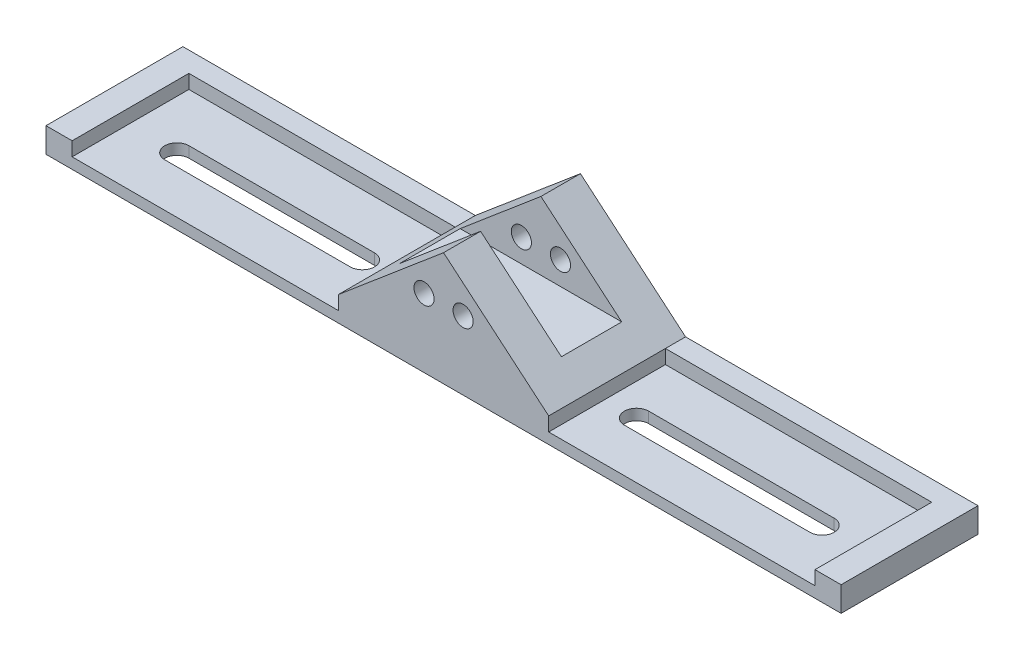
ISO-10303-21;
HEADER;
FILE_DESCRIPTION(('STEP AP214'),'2;1');
FILE_NAME('part.step','',(''),(''),'','','');
FILE_SCHEMA(('AUTOMOTIVE_DESIGN { 1 0 10303 214 1 1 1 1 }'));
ENDSEC;
DATA;
#1=APPLICATION_CONTEXT('core data for automotive mechanical design processes');
#2=APPLICATION_PROTOCOL_DEFINITION('international standard','automotive_design',2000,#1);
#3=PRODUCT_CONTEXT('',#1,'mechanical');
#4=PRODUCT('Part','Part','',(#3));
#5=PRODUCT_RELATED_PRODUCT_CATEGORY('part','',(#4));
#6=PRODUCT_DEFINITION_FORMATION('','',#4);
#7=PRODUCT_DEFINITION_CONTEXT('part definition',#1,'design');
#8=PRODUCT_DEFINITION('design','',#6,#7);
#9=PRODUCT_DEFINITION_SHAPE('','',#8);
#10=(LENGTH_UNIT() NAMED_UNIT(*) SI_UNIT(.MILLI.,.METRE.));
#11=(NAMED_UNIT(*) PLANE_ANGLE_UNIT() SI_UNIT($,.RADIAN.));
#12=(NAMED_UNIT(*) SI_UNIT($,.STERADIAN.) SOLID_ANGLE_UNIT());
#13=UNCERTAINTY_MEASURE_WITH_UNIT(LENGTH_MEASURE(1.E-05),#10,'distance_accuracy_value','');
#14=(GEOMETRIC_REPRESENTATION_CONTEXT(3) GLOBAL_UNCERTAINTY_ASSIGNED_CONTEXT((#13)) GLOBAL_UNIT_ASSIGNED_CONTEXT((#10,
#11,#12)) REPRESENTATION_CONTEXT('',''));
#15=CARTESIAN_POINT('',(0.,0.,0.));
#16=DIRECTION('',(0.,0.,1.));
#17=DIRECTION('',(1.,0.,0.));
#18=AXIS2_PLACEMENT_3D('',#15,#16,#17);
#19=CARTESIAN_POINT('',(-70.5231209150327,18.542,48.9541938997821));
#20=DIRECTION('',(0.,1.,0.));
#21=DIRECTION('',(0.,0.,1.));
#22=AXIS2_PLACEMENT_3D('',#19,#20,#21);
#23=PLANE('',#22);
#24=DIRECTION('',(-1.,0.,0.));
#25=VECTOR('',#24,1.);
#26=CARTESIAN_POINT('',(8.00572916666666,18.542,-38.265965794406));
#27=LINE('',#26,#25);
#28=CARTESIAN_POINT('',(206.95294283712,18.542,-38.265965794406));
#29=VERTEX_POINT('',#28);
#30=CARTESIAN_POINT('',(8.00572916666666,18.542,-38.265965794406));
#31=VERTEX_POINT('',#30);
#32=EDGE_CURVE('E377',#29,#31,#27,.T.);
#33=ORIENTED_EDGE('',*,*,#32,.F.);
#34=DIRECTION('',(0.,0.,-1.));
#35=VECTOR('',#34,1.);
#36=CARTESIAN_POINT('',(206.95294283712,18.542,48.9541938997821));
#37=LINE('',#36,#35);
#38=CARTESIAN_POINT('',(206.95294283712,18.542,48.9541938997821));
#39=VERTEX_POINT('',#38);
#40=EDGE_CURVE('E371',#39,#29,#37,.T.);
#41=ORIENTED_EDGE('',*,*,#40,.F.);
#42=DIRECTION('',(1.,0.,0.));
#43=VECTOR('',#42,1.);
#44=CARTESIAN_POINT('',(-70.5231209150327,18.542,48.9541938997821));
#45=LINE('',#44,#43);
#46=CARTESIAN_POINT('',(226.47339234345,18.542,48.9541938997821));
#47=VERTEX_POINT('',#46);
#48=EDGE_CURVE('E358',#39,#47,#45,.T.);
#49=ORIENTED_EDGE('',*,*,#48,.T.);
#50=DIRECTION('',(0.,0.,-1.));
#51=VECTOR('',#50,1.);
#52=CARTESIAN_POINT('',(226.47339234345,18.542,-53.3164488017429));
#53=LINE('',#52,#51);
#54=CARTESIAN_POINT('',(226.47339234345,18.542,-53.3164488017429));
#55=VERTEX_POINT('',#54);
#56=EDGE_CURVE('E361',#47,#55,#53,.T.);
#57=ORIENTED_EDGE('',*,*,#56,.T.);
#58=DIRECTION('',(-1.,0.,0.));
#59=VECTOR('',#58,1.);
#60=CARTESIAN_POINT('',(-70.5231209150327,18.542,-53.3164488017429));
#61=LINE('',#60,#59);
#62=CARTESIAN_POINT('',(8.00572916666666,18.542,-53.3164488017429));
#63=VERTEX_POINT('',#62);
#64=EDGE_CURVE('E342',#55,#63,#61,.T.);
#65=ORIENTED_EDGE('',*,*,#64,.T.);
#66=DIRECTION('',(0.,0.,1.));
#67=VECTOR('',#66,1.);
#68=CARTESIAN_POINT('',(8.00572916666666,18.542,-156.106389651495));
#69=LINE('',#68,#67);
#70=EDGE_CURVE('E332',#63,#31,#69,.T.);
#71=ORIENTED_EDGE('',*,*,#70,.T.);
#72=EDGE_LOOP('',(#33,#41,#49,#57,#65,#71));
#73=FACE_BOUND('',#72,.T.);
#74=ADVANCED_FACE('F26',(#73),#23,.T.);
#75=CARTESIAN_POINT('',(-70.5231209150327,18.542,48.9541938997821));
#76=DIRECTION('',(0.,0.,-1.));
#77=DIRECTION('',(-1.,0.,0.));
#78=AXIS2_PLACEMENT_3D('',#75,#76,#77);
#79=PLANE('',#78);
#80=CARTESIAN_POINT('',(-55.9159542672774,51.2780309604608,48.9541938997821));
#81=DIRECTION('',(0.,0.,1.));
#82=DIRECTION('',(1.,0.,0.));
#83=AXIS2_PLACEMENT_3D('',#80,#81,#82);
#84=CIRCLE('',#83,7.52590952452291);
#85=CARTESIAN_POINT('',(-48.3900447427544,51.2780309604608,48.9541938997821));
#86=VERTEX_POINT('',#85);
#87=EDGE_CURVE('E292',#86,#86,#84,.T.);
#88=ORIENTED_EDGE('',*,*,#87,.F.);
#89=EDGE_LOOP('',(#88));
#90=FACE_BOUND('',#89,.T.);
#91=DIRECTION('',(1.,0.,0.));
#92=VECTOR('',#91,1.);
#93=CARTESIAN_POINT('',(8.00572916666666,8.128,48.9541938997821));
#94=LINE('',#93,#92);
#95=CARTESIAN_POINT('',(8.00572916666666,8.128,48.9541938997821));
#96=VERTEX_POINT('',#95);
#97=CARTESIAN_POINT('',(206.95294283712,8.128,48.9541938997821));
#98=VERTEX_POINT('',#97);
#99=EDGE_CURVE('E396',#96,#98,#94,.T.);
#100=ORIENTED_EDGE('',*,*,#99,.F.);
#101=DIRECTION('',(0.,1.,0.));
#102=VECTOR('',#101,1.);
#103=CARTESIAN_POINT('',(8.00572916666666,8.128,48.9541938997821));
#104=LINE('',#103,#102);
#105=CARTESIAN_POINT('',(8.00572916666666,18.542,48.9541938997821));
#106=VERTEX_POINT('',#105);
#107=EDGE_CURVE('E331',#96,#106,#104,.T.);
#108=ORIENTED_EDGE('',*,*,#107,.T.);
#109=DIRECTION('',(-0.763974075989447,0.645246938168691,0.));
#110=VECTOR('',#109,1.);
#111=CARTESIAN_POINT('',(8.00572916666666,18.542,48.9541938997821));
#112=LINE('',#111,#110);
#113=CARTESIAN_POINT('',(-70.5231209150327,84.8668946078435,48.9541938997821));
#114=VERTEX_POINT('',#113);
#115=EDGE_CURVE('E325',#106,#114,#112,.T.);
#116=ORIENTED_EDGE('',*,*,#115,.T.);
#117=DIRECTION('',(0.763974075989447,0.645246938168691,0.));
#118=VECTOR('',#117,1.);
#119=CARTESIAN_POINT('',(-149.051970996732,18.542,48.9541938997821));
#120=LINE('',#119,#118);
#121=CARTESIAN_POINT('',(-149.051970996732,18.542,48.9541938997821));
#122=VERTEX_POINT('',#121);
#123=EDGE_CURVE('E259',#122,#114,#120,.T.);
#124=ORIENTED_EDGE('',*,*,#123,.F.);
#125=DIRECTION('',(0.,1.,0.));
#126=VECTOR('',#125,1.);
#127=CARTESIAN_POINT('',(-149.051970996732,8.128,48.9541938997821));
#128=LINE('',#127,#126);
#129=CARTESIAN_POINT('',(-149.051970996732,8.128,48.9541938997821));
#130=VERTEX_POINT('',#129);
#131=EDGE_CURVE('E256',#130,#122,#128,.T.);
#132=ORIENTED_EDGE('',*,*,#131,.F.);
#133=DIRECTION('',(-1.,0.,0.));
#134=VECTOR('',#133,1.);
#135=CARTESIAN_POINT('',(-149.051970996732,8.128,48.9541938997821));
#136=LINE('',#135,#134);
#137=CARTESIAN_POINT('',(-347.999184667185,8.128,48.9541938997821));
#138=VERTEX_POINT('',#137);
#139=EDGE_CURVE('E249',#130,#138,#136,.T.);
#140=ORIENTED_EDGE('',*,*,#139,.T.);
#141=DIRECTION('',(0.,1.,0.));
#142=VECTOR('',#141,1.);
#143=CARTESIAN_POINT('',(-347.999184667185,8.128,48.9541938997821));
#144=LINE('',#143,#142);
#145=CARTESIAN_POINT('',(-347.999184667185,18.542,48.9541938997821));
#146=VERTEX_POINT('',#145);
#147=EDGE_CURVE('E262',#138,#146,#144,.T.);
#148=ORIENTED_EDGE('',*,*,#147,.T.);
#149=DIRECTION('',(-1.,0.,0.));
#150=VECTOR('',#149,1.);
#151=CARTESIAN_POINT('',(-70.5231209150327,18.542,48.9541938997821));
#152=LINE('',#151,#150);
#153=CARTESIAN_POINT('',(-367.519634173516,18.542,48.9541938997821));
#154=VERTEX_POINT('',#153);
#155=EDGE_CURVE('E293',#146,#154,#152,.T.);
#156=ORIENTED_EDGE('',*,*,#155,.T.);
#157=DIRECTION('',(0.,-1.,0.));
#158=VECTOR('',#157,1.);
#159=CARTESIAN_POINT('',(-367.519634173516,18.542,48.9541938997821));
#160=LINE('',#159,#158);
#161=CARTESIAN_POINT('',(-367.519634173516,0.,48.9541938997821));
#162=VERTEX_POINT('',#161);
#163=EDGE_CURVE('E287',#154,#162,#160,.T.);
#164=ORIENTED_EDGE('',*,*,#163,.T.);
#165=DIRECTION('',(1.,0.,0.));
#166=VECTOR('',#165,1.);
#167=CARTESIAN_POINT('',(-70.5231209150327,0.,48.9541938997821));
#168=LINE('',#167,#166);
#169=CARTESIAN_POINT('',(226.47339234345,0.,48.9541938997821));
#170=VERTEX_POINT('',#169);
#171=EDGE_CURVE('E352',#162,#170,#168,.T.);
#172=ORIENTED_EDGE('',*,*,#171,.T.);
#173=DIRECTION('',(0.,-1.,0.));
#174=VECTOR('',#173,1.);
#175=CARTESIAN_POINT('',(226.47339234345,18.542,48.9541938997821));
#176=LINE('',#175,#174);
#177=EDGE_CURVE('E417',#47,#170,#176,.T.);
#178=ORIENTED_EDGE('',*,*,#177,.F.);
#179=ORIENTED_EDGE('',*,*,#48,.F.);
#180=DIRECTION('',(0.,1.,0.));
#181=VECTOR('',#180,1.);
#182=CARTESIAN_POINT('',(206.95294283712,8.128,48.9541938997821));
#183=LINE('',#182,#181);
#184=EDGE_CURVE('E366',#98,#39,#183,.T.);
#185=ORIENTED_EDGE('',*,*,#184,.F.);
#186=EDGE_LOOP('',(#100,#108,#116,#124,#132,#140,#148,#156,#164,#172,#178,#179,#185));
#187=FACE_BOUND('',#186,.T.);
#188=CARTESIAN_POINT('',(-85.130287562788,51.2780309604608,48.9541938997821));
#189=DIRECTION('',(0.,0.,-1.));
#190=DIRECTION('',(-1.,0.,0.));
#191=AXIS2_PLACEMENT_3D('',#188,#189,#190);
#192=CIRCLE('',#191,7.52590952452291);
#193=CARTESIAN_POINT('',(-92.6561970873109,51.2780309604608,48.9541938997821));
#194=VERTEX_POINT('',#193);
#195=EDGE_CURVE('E475',#194,#194,#192,.T.);
#196=ORIENTED_EDGE('',*,*,#195,.T.);
#197=EDGE_LOOP('',(#196));
#198=FACE_BOUND('',#197,.T.);
#199=ADVANCED_FACE('F28',(#90,#187,#198),#79,.F.);
#200=CARTESIAN_POINT('',(226.47339234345,18.542,-53.3164488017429));
#201=DIRECTION('',(-1.,0.,0.));
#202=DIRECTION('',(0.,0.,1.));
#203=AXIS2_PLACEMENT_3D('',#200,#201,#202);
#204=PLANE('',#203);
#205=DIRECTION('',(0.,0.,-1.));
#206=VECTOR('',#205,1.);
#207=CARTESIAN_POINT('',(226.47339234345,0.,-53.3164488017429));
#208=LINE('',#207,#206);
#209=CARTESIAN_POINT('',(226.47339234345,0.,-53.3164488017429));
#210=VERTEX_POINT('',#209);
#211=EDGE_CURVE('E354',#170,#210,#208,.T.);
#212=ORIENTED_EDGE('',*,*,#211,.T.);
#213=DIRECTION('',(0.,-1.,0.));
#214=VECTOR('',#213,1.);
#215=CARTESIAN_POINT('',(226.47339234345,18.542,-53.3164488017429));
#216=LINE('',#215,#214);
#217=EDGE_CURVE('E423',#55,#210,#216,.T.);
#218=ORIENTED_EDGE('',*,*,#217,.F.);
#219=ORIENTED_EDGE('',*,*,#56,.F.);
#220=ORIENTED_EDGE('',*,*,#177,.T.);
#221=EDGE_LOOP('',(#212,#218,#219,#220));
#222=FACE_BOUND('',#221,.T.);
#223=ADVANCED_FACE('F425',(#222),#204,.F.);
#224=CARTESIAN_POINT('',(-70.5231209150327,18.542,-53.3164488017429));
#225=DIRECTION('',(0.,0.,1.));
#226=DIRECTION('',(1.,0.,0.));
#227=AXIS2_PLACEMENT_3D('',#224,#225,#226);
#228=PLANE('',#227);
#229=CARTESIAN_POINT('',(-55.9159542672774,51.2780309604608,-53.3164488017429));
#230=DIRECTION('',(0.,0.,1.));
#231=DIRECTION('',(1.,0.,0.));
#232=AXIS2_PLACEMENT_3D('',#229,#230,#231);
#233=CIRCLE('',#232,7.52590952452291);
#234=CARTESIAN_POINT('',(-48.3900447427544,51.2780309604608,-53.3164488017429));
#235=VERTEX_POINT('',#234);
#236=EDGE_CURVE('E490',#235,#235,#233,.T.);
#237=ORIENTED_EDGE('',*,*,#236,.T.);
#238=EDGE_LOOP('',(#237));
#239=FACE_BOUND('',#238,.T.);
#240=DIRECTION('',(-1.,0.,0.));
#241=VECTOR('',#240,1.);
#242=CARTESIAN_POINT('',(-70.5231209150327,0.,-53.3164488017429));
#243=LINE('',#242,#241);
#244=CARTESIAN_POINT('',(-367.519634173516,0.,-53.3164488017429));
#245=VERTEX_POINT('',#244);
#246=EDGE_CURVE('E356',#210,#245,#243,.T.);
#247=ORIENTED_EDGE('',*,*,#246,.T.);
#248=DIRECTION('',(0.,-1.,0.));
#249=VECTOR('',#248,1.);
#250=CARTESIAN_POINT('',(-367.519634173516,18.542,-53.3164488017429));
#251=LINE('',#250,#249);
#252=CARTESIAN_POINT('',(-367.519634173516,18.542,-53.3164488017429));
#253=VERTEX_POINT('',#252);
#254=EDGE_CURVE('E305',#253,#245,#251,.T.);
#255=ORIENTED_EDGE('',*,*,#254,.F.);
#256=DIRECTION('',(1.,0.,0.));
#257=VECTOR('',#256,1.);
#258=CARTESIAN_POINT('',(-70.5231209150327,18.542,-53.3164488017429));
#259=LINE('',#258,#257);
#260=CARTESIAN_POINT('',(-149.051970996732,18.542,-53.3164488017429));
#261=VERTEX_POINT('',#260);
#262=EDGE_CURVE('E302',#253,#261,#259,.T.);
#263=ORIENTED_EDGE('',*,*,#262,.T.);
#264=DIRECTION('',(-0.763974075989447,-0.645246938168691,0.));
#265=VECTOR('',#264,1.);
#266=CARTESIAN_POINT('',(-149.051970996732,18.542,-53.3164488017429));
#267=LINE('',#266,#265);
#268=CARTESIAN_POINT('',(-70.5231209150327,84.8668946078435,-53.3164488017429));
#269=VERTEX_POINT('',#268);
#270=EDGE_CURVE('E267',#269,#261,#267,.T.);
#271=ORIENTED_EDGE('',*,*,#270,.F.);
#272=DIRECTION('',(0.763974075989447,-0.645246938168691,0.));
#273=VECTOR('',#272,1.);
#274=CARTESIAN_POINT('',(8.00572916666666,18.542,-53.3164488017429));
#275=LINE('',#274,#273);
#276=EDGE_CURVE('E336',#269,#63,#275,.T.);
#277=ORIENTED_EDGE('',*,*,#276,.T.);
#278=ORIENTED_EDGE('',*,*,#64,.F.);
#279=ORIENTED_EDGE('',*,*,#217,.T.);
#280=EDGE_LOOP('',(#247,#255,#263,#271,#277,#278,#279));
#281=FACE_BOUND('',#280,.T.);
#282=CARTESIAN_POINT('',(-85.130287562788,51.2780309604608,-53.3164488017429));
#283=DIRECTION('',(0.,0.,-1.));
#284=DIRECTION('',(-1.,0.,0.));
#285=AXIS2_PLACEMENT_3D('',#282,#283,#284);
#286=CIRCLE('',#285,7.52590952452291);
#287=CARTESIAN_POINT('',(-92.6561970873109,51.2780309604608,-53.3164488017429));
#288=VERTEX_POINT('',#287);
#289=EDGE_CURVE('E222',#288,#288,#286,.T.);
#290=ORIENTED_EDGE('',*,*,#289,.F.);
#291=EDGE_LOOP('',(#290));
#292=FACE_BOUND('',#291,.T.);
#293=ADVANCED_FACE('F433',(#239,#281,#292),#228,.F.);
#294=CARTESIAN_POINT('',(-70.5231209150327,0.,48.9541938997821));
#295=DIRECTION('',(0.,1.,0.));
#296=DIRECTION('',(0.,0.,1.));
#297=AXIS2_PLACEMENT_3D('',#294,#295,#296);
#298=PLANE('',#297);
#299=DIRECTION('',(1.,0.,0.));
#300=VECTOR('',#299,1.);
#301=CARTESIAN_POINT('',(170.465352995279,0.,16.2680207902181));
#302=LINE('',#301,#300);
#303=CARTESIAN_POINT('',(31.9043359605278,0.,16.2680207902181));
#304=VERTEX_POINT('',#303);
#305=CARTESIAN_POINT('',(170.465352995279,0.,16.2680207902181));
#306=VERTEX_POINT('',#305);
#307=EDGE_CURVE('E386',#304,#306,#302,.T.);
#308=ORIENTED_EDGE('',*,*,#307,.T.);
#309=CARTESIAN_POINT('',(170.465352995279,0.,7.17998742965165));
#310=DIRECTION('',(0.,1.,0.));
#311=DIRECTION('',(0.,0.,1.));
#312=AXIS2_PLACEMENT_3D('',#309,#310,#311);
#313=CIRCLE('',#312,9.08803336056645);
#314=CARTESIAN_POINT('',(170.465352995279,0.,-1.90804593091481));
#315=VERTEX_POINT('',#314);
#316=EDGE_CURVE('E502',#306,#315,#313,.T.);
#317=ORIENTED_EDGE('',*,*,#316,.T.);
#318=DIRECTION('',(-1.,0.,0.));
#319=VECTOR('',#318,1.);
#320=CARTESIAN_POINT('',(170.465352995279,0.,-1.90804593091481));
#321=LINE('',#320,#319);
#322=CARTESIAN_POINT('',(31.9043359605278,0.,-1.90804593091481));
#323=VERTEX_POINT('',#322);
#324=EDGE_CURVE('E505',#315,#323,#321,.T.);
#325=ORIENTED_EDGE('',*,*,#324,.T.);
#326=CARTESIAN_POINT('',(31.9043359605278,0.,7.17998742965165));
#327=DIRECTION('',(0.,1.,0.));
#328=DIRECTION('',(0.,0.,1.));
#329=AXIS2_PLACEMENT_3D('',#326,#327,#328);
#330=CIRCLE('',#329,9.08803336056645);
#331=EDGE_CURVE('E43',#323,#304,#330,.T.);
#332=ORIENTED_EDGE('',*,*,#331,.T.);
#333=EDGE_LOOP('',(#308,#317,#325,#332));
#334=FACE_BOUND('',#333,.T.);
#335=ORIENTED_EDGE('',*,*,#171,.F.);
#336=DIRECTION('',(0.,0.,-1.));
#337=VECTOR('',#336,1.);
#338=CARTESIAN_POINT('',(-367.519634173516,0.,-53.3164488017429));
#339=LINE('',#338,#337);
#340=EDGE_CURVE('E271',#162,#245,#339,.T.);
#341=ORIENTED_EDGE('',*,*,#340,.T.);
#342=ORIENTED_EDGE('',*,*,#246,.F.);
#343=ORIENTED_EDGE('',*,*,#211,.F.);
#344=EDGE_LOOP('',(#335,#341,#342,#343));
#345=FACE_BOUND('',#344,.T.);
#346=DIRECTION('',(-1.,0.,0.));
#347=VECTOR('',#346,1.);
#348=CARTESIAN_POINT('',(-311.511594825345,0.,16.2680207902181));
#349=LINE('',#348,#347);
#350=CARTESIAN_POINT('',(-172.950577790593,0.,16.2680207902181));
#351=VERTEX_POINT('',#350);
#352=CARTESIAN_POINT('',(-311.511594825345,0.,16.2680207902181));
#353=VERTEX_POINT('',#352);
#354=EDGE_CURVE('E233',#351,#353,#349,.T.);
#355=ORIENTED_EDGE('',*,*,#354,.F.);
#356=CARTESIAN_POINT('',(-172.950577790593,0.,7.17998742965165));
#357=DIRECTION('',(0.,-1.,0.));
#358=DIRECTION('',(0.,0.,1.));
#359=AXIS2_PLACEMENT_3D('',#356,#357,#358);
#360=CIRCLE('',#359,9.08803336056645);
#361=CARTESIAN_POINT('',(-172.950577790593,0.,-1.90804593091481));
#362=VERTEX_POINT('',#361);
#363=EDGE_CURVE('E231',#362,#351,#360,.T.);
#364=ORIENTED_EDGE('',*,*,#363,.F.);
#365=DIRECTION('',(1.,0.,0.));
#366=VECTOR('',#365,1.);
#367=CARTESIAN_POINT('',(-311.511594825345,0.,-1.90804593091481));
#368=LINE('',#367,#366);
#369=CARTESIAN_POINT('',(-311.511594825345,0.,-1.90804593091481));
#370=VERTEX_POINT('',#369);
#371=EDGE_CURVE('E201',#370,#362,#368,.T.);
#372=ORIENTED_EDGE('',*,*,#371,.F.);
#373=CARTESIAN_POINT('',(-311.511594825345,0.,7.17998742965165));
#374=DIRECTION('',(0.,-1.,0.));
#375=DIRECTION('',(0.,0.,1.));
#376=AXIS2_PLACEMENT_3D('',#373,#374,#375);
#377=CIRCLE('',#376,9.08803336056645);
#378=EDGE_CURVE('E227',#353,#370,#377,.T.);
#379=ORIENTED_EDGE('',*,*,#378,.F.);
#380=EDGE_LOOP('',(#355,#364,#372,#379));
#381=FACE_BOUND('',#380,.T.);
#382=ADVANCED_FACE('F438',(#334,#345,#381),#298,.F.);
#383=CARTESIAN_POINT('',(8.00572916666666,18.542,-156.106389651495));
#384=DIRECTION('',(0.645246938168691,0.763974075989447,0.));
#385=DIRECTION('',(-0.763974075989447,0.645246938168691,0.));
#386=AXIS2_PLACEMENT_3D('',#383,#384,#385);
#387=PLANE('',#386);
#388=DIRECTION('',(-0.763974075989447,0.645246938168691,0.));
#389=VECTOR('',#388,1.);
#390=CARTESIAN_POINT('',(8.00572916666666,18.542,-23.7907597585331));
#391=LINE('',#390,#389);
#392=CARTESIAN_POINT('',(-10.1569358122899,33.8820545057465,-23.7907597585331));
#393=VERTEX_POINT('',#392);
#394=CARTESIAN_POINT('',(-70.5231209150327,84.8668946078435,-23.7907597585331));
#395=VERTEX_POINT('',#394);
#396=EDGE_CURVE('E11',#393,#395,#391,.T.);
#397=ORIENTED_EDGE('',*,*,#396,.F.);
#398=DIRECTION('',(0.,0.,-1.));
#399=VECTOR('',#398,1.);
#400=CARTESIAN_POINT('',(-10.1569358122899,33.8820545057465,-156.106389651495));
#401=LINE('',#400,#399);
#402=CARTESIAN_POINT('',(-10.1569358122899,33.8820545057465,21.2774573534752));
#403=VERTEX_POINT('',#402);
#404=EDGE_CURVE('E422',#403,#393,#401,.T.);
#405=ORIENTED_EDGE('',*,*,#404,.F.);
#406=DIRECTION('',(0.763974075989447,-0.645246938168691,0.));
#407=VECTOR('',#406,1.);
#408=CARTESIAN_POINT('',(8.00572916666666,18.542,21.2774573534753));
#409=LINE('',#408,#407);
#410=CARTESIAN_POINT('',(-70.5231209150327,84.8668946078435,21.2774573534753));
#411=VERTEX_POINT('',#410);
#412=EDGE_CURVE('E35',#411,#403,#409,.T.);
#413=ORIENTED_EDGE('',*,*,#412,.F.);
#414=DIRECTION('',(0.,0.,1.));
#415=VECTOR('',#414,1.);
#416=CARTESIAN_POINT('',(-70.5231209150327,84.8668946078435,-156.106389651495));
#417=LINE('',#416,#415);
#418=EDGE_CURVE('E268',#411,#114,#417,.T.);
#419=ORIENTED_EDGE('',*,*,#418,.T.);
#420=ORIENTED_EDGE('',*,*,#115,.F.);
#421=DIRECTION('',(0.,0.,1.));
#422=VECTOR('',#421,1.);
#423=CARTESIAN_POINT('',(8.00572916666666,18.542,48.9541938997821));
#424=LINE('',#423,#422);
#425=EDGE_CURVE('E370',#31,#106,#424,.T.);
#426=ORIENTED_EDGE('',*,*,#425,.F.);
#427=ORIENTED_EDGE('',*,*,#70,.F.);
#428=ORIENTED_EDGE('',*,*,#276,.F.);
#429=EDGE_CURVE('E264',#269,#395,#417,.T.);
#430=ORIENTED_EDGE('',*,*,#429,.T.);
#431=EDGE_LOOP('',(#397,#405,#413,#419,#420,#426,#427,#428,#430));
#432=FACE_BOUND('',#431,.T.);
#433=ADVANCED_FACE('F323',(#432),#387,.T.);
#434=CARTESIAN_POINT('',(226.47341734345,84.8668946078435,-23.7907597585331));
#435=DIRECTION('',(0.,0.,-1.));
#436=DIRECTION('',(-1.,0.,0.));
#437=AXIS2_PLACEMENT_3D('',#434,#435,#436);
#438=PLANE('',#437);
#439=CARTESIAN_POINT('',(-55.9159542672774,51.2780309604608,-23.7907597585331));
#440=DIRECTION('',(0.,0.,-1.));
#441=DIRECTION('',(-1.,0.,0.));
#442=AXIS2_PLACEMENT_3D('',#439,#440,#441);
#443=CIRCLE('',#442,7.52590952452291);
#444=CARTESIAN_POINT('',(-63.4418637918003,51.2780309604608,-23.7907597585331));
#445=VERTEX_POINT('',#444);
#446=EDGE_CURVE('E487',#445,#445,#443,.T.);
#447=ORIENTED_EDGE('',*,*,#446,.T.);
#448=EDGE_LOOP('',(#447));
#449=FACE_BOUND('',#448,.T.);
#450=ORIENTED_EDGE('',*,*,#396,.T.);
#451=DIRECTION('',(0.763974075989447,0.645246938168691,0.));
#452=VECTOR('',#451,1.);
#453=CARTESIAN_POINT('',(-149.051970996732,18.542,-23.7907597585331));
#454=LINE('',#453,#452);
#455=CARTESIAN_POINT('',(-130.889306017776,33.8820545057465,-23.7907597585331));
#456=VERTEX_POINT('',#455);
#457=EDGE_CURVE('E290',#456,#395,#454,.T.);
#458=ORIENTED_EDGE('',*,*,#457,.F.);
#459=DIRECTION('',(-1.,0.,0.));
#460=VECTOR('',#459,1.);
#461=CARTESIAN_POINT('',(226.47341734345,33.8820545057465,-23.7907597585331));
#462=LINE('',#461,#460);
#463=EDGE_CURVE('E338',#393,#456,#462,.T.);
#464=ORIENTED_EDGE('',*,*,#463,.F.);
#465=EDGE_LOOP('',(#450,#458,#464));
#466=FACE_BOUND('',#465,.T.);
#467=CARTESIAN_POINT('',(-85.130287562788,51.2780309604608,-23.7907597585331));
#468=DIRECTION('',(0.,0.,1.));
#469=DIRECTION('',(1.,0.,0.));
#470=AXIS2_PLACEMENT_3D('',#467,#468,#469);
#471=CIRCLE('',#470,7.52590952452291);
#472=CARTESIAN_POINT('',(-77.6043780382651,51.2780309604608,-23.7907597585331));
#473=VERTEX_POINT('',#472);
#474=EDGE_CURVE('E474',#473,#473,#471,.T.);
#475=ORIENTED_EDGE('',*,*,#474,.F.);
#476=EDGE_LOOP('',(#475));
#477=FACE_BOUND('',#476,.T.);
#478=ADVANCED_FACE('F457',(#449,#466,#477),#438,.F.);
#479=CARTESIAN_POINT('',(226.47341734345,84.8668946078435,21.2774573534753));
#480=DIRECTION('',(0.,0.,1.));
#481=DIRECTION('',(1.,0.,0.));
#482=AXIS2_PLACEMENT_3D('',#479,#480,#481);
#483=PLANE('',#482);
#484=CARTESIAN_POINT('',(-55.9159542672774,51.2780309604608,21.2774573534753));
#485=DIRECTION('',(0.,0.,1.));
#486=DIRECTION('',(1.,0.,0.));
#487=AXIS2_PLACEMENT_3D('',#484,#485,#486);
#488=CIRCLE('',#487,7.52590952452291);
#489=CARTESIAN_POINT('',(-48.3900447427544,51.2780309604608,21.2774573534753));
#490=VERTEX_POINT('',#489);
#491=EDGE_CURVE('E30',#490,#490,#488,.T.);
#492=ORIENTED_EDGE('',*,*,#491,.T.);
#493=EDGE_LOOP('',(#492));
#494=FACE_BOUND('',#493,.T.);
#495=ORIENTED_EDGE('',*,*,#412,.T.);
#496=DIRECTION('',(-1.,0.,0.));
#497=VECTOR('',#496,1.);
#498=CARTESIAN_POINT('',(226.47341734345,33.8820545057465,21.2774573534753));
#499=LINE('',#498,#497);
#500=CARTESIAN_POINT('',(-130.889306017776,33.8820545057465,21.2774573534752));
#501=VERTEX_POINT('',#500);
#502=EDGE_CURVE('E333',#403,#501,#499,.T.);
#503=ORIENTED_EDGE('',*,*,#502,.T.);
#504=DIRECTION('',(-0.763974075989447,-0.645246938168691,0.));
#505=VECTOR('',#504,1.);
#506=CARTESIAN_POINT('',(-149.051970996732,18.542,21.2774573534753));
#507=LINE('',#506,#505);
#508=EDGE_CURVE('E286',#411,#501,#507,.T.);
#509=ORIENTED_EDGE('',*,*,#508,.F.);
#510=EDGE_LOOP('',(#495,#503,#509));
#511=FACE_BOUND('',#510,.T.);
#512=CARTESIAN_POINT('',(-85.130287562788,51.2780309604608,21.2774573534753));
#513=DIRECTION('',(0.,0.,-1.));
#514=DIRECTION('',(-1.,0.,0.));
#515=AXIS2_PLACEMENT_3D('',#512,#513,#514);
#516=CIRCLE('',#515,7.52590952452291);
#517=CARTESIAN_POINT('',(-92.6561970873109,51.2780309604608,21.2774573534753));
#518=VERTEX_POINT('',#517);
#519=EDGE_CURVE('E472',#518,#518,#516,.T.);
#520=ORIENTED_EDGE('',*,*,#519,.F.);
#521=EDGE_LOOP('',(#520));
#522=FACE_BOUND('',#521,.T.);
#523=ADVANCED_FACE('F463',(#494,#511,#522),#483,.F.);
#524=CARTESIAN_POINT('',(226.47341734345,33.8820545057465,-23.7907597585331));
#525=DIRECTION('',(0.,-1.,0.));
#526=DIRECTION('',(0.,0.,-1.));
#527=AXIS2_PLACEMENT_3D('',#524,#525,#526);
#528=PLANE('',#527);
#529=ORIENTED_EDGE('',*,*,#404,.T.);
#530=ORIENTED_EDGE('',*,*,#463,.T.);
#531=DIRECTION('',(0.,0.,-1.));
#532=VECTOR('',#531,1.);
#533=CARTESIAN_POINT('',(-130.889306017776,33.8820545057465,-156.106389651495));
#534=LINE('',#533,#532);
#535=EDGE_CURVE('E283',#501,#456,#534,.T.);
#536=ORIENTED_EDGE('',*,*,#535,.F.);
#537=ORIENTED_EDGE('',*,*,#502,.F.);
#538=EDGE_LOOP('',(#529,#530,#536,#537));
#539=FACE_BOUND('',#538,.T.);
#540=ADVANCED_FACE('F461',(#539),#528,.F.);
#541=CARTESIAN_POINT('',(8.00572916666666,8.128,48.9541938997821));
#542=DIRECTION('',(-1.,0.,0.));
#543=DIRECTION('',(0.,0.,1.));
#544=AXIS2_PLACEMENT_3D('',#541,#542,#543);
#545=PLANE('',#544);
#546=ORIENTED_EDGE('',*,*,#425,.T.);
#547=ORIENTED_EDGE('',*,*,#107,.F.);
#548=DIRECTION('',(0.,0.,1.));
#549=VECTOR('',#548,1.);
#550=CARTESIAN_POINT('',(8.00572916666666,8.128,48.9541938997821));
#551=LINE('',#550,#549);
#552=CARTESIAN_POINT('',(8.00572916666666,8.128,-38.265965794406));
#553=VERTEX_POINT('',#552);
#554=EDGE_CURVE('E393',#553,#96,#551,.T.);
#555=ORIENTED_EDGE('',*,*,#554,.F.);
#556=DIRECTION('',(0.,1.,0.));
#557=VECTOR('',#556,1.);
#558=CARTESIAN_POINT('',(8.00572916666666,8.128,-38.265965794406));
#559=LINE('',#558,#557);
#560=EDGE_CURVE('E404',#553,#31,#559,.T.);
#561=ORIENTED_EDGE('',*,*,#560,.T.);
#562=EDGE_LOOP('',(#546,#547,#555,#561));
#563=FACE_BOUND('',#562,.T.);
#564=ADVANCED_FACE('F527',(#563),#545,.F.);
#565=CARTESIAN_POINT('',(8.00572916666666,8.128,-38.265965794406));
#566=DIRECTION('',(0.,0.,-1.));
#567=DIRECTION('',(-1.,0.,0.));
#568=AXIS2_PLACEMENT_3D('',#565,#566,#567);
#569=PLANE('',#568);
#570=ORIENTED_EDGE('',*,*,#32,.T.);
#571=ORIENTED_EDGE('',*,*,#560,.F.);
#572=DIRECTION('',(-1.,0.,0.));
#573=VECTOR('',#572,1.);
#574=CARTESIAN_POINT('',(8.00572916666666,8.128,-38.265965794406));
#575=LINE('',#574,#573);
#576=CARTESIAN_POINT('',(206.95294283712,8.128,-38.265965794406));
#577=VERTEX_POINT('',#576);
#578=EDGE_CURVE('E367',#577,#553,#575,.T.);
#579=ORIENTED_EDGE('',*,*,#578,.F.);
#580=DIRECTION('',(0.,1.,0.));
#581=VECTOR('',#580,1.);
#582=CARTESIAN_POINT('',(206.95294283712,8.128,-38.265965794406));
#583=LINE('',#582,#581);
#584=EDGE_CURVE('E406',#577,#29,#583,.T.);
#585=ORIENTED_EDGE('',*,*,#584,.T.);
#586=EDGE_LOOP('',(#570,#571,#579,#585));
#587=FACE_BOUND('',#586,.T.);
#588=ADVANCED_FACE('F529',(#587),#569,.F.);
#589=CARTESIAN_POINT('',(206.95294283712,8.128,48.9541938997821));
#590=DIRECTION('',(1.,0.,0.));
#591=DIRECTION('',(0.,0.,-1.));
#592=AXIS2_PLACEMENT_3D('',#589,#590,#591);
#593=PLANE('',#592);
#594=ORIENTED_EDGE('',*,*,#40,.T.);
#595=ORIENTED_EDGE('',*,*,#584,.F.);
#596=DIRECTION('',(0.,0.,-1.));
#597=VECTOR('',#596,1.);
#598=CARTESIAN_POINT('',(206.95294283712,8.128,48.9541938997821));
#599=LINE('',#598,#597);
#600=EDGE_CURVE('E399',#98,#577,#599,.T.);
#601=ORIENTED_EDGE('',*,*,#600,.F.);
#602=ORIENTED_EDGE('',*,*,#184,.T.);
#603=EDGE_LOOP('',(#594,#595,#601,#602));
#604=FACE_BOUND('',#603,.T.);
#605=ADVANCED_FACE('F411',(#604),#593,.F.);
#606=CARTESIAN_POINT('',(8.00572916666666,8.128,-38.265965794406));
#607=DIRECTION('',(0.,-1.,0.));
#608=DIRECTION('',(0.,0.,-1.));
#609=AXIS2_PLACEMENT_3D('',#606,#607,#608);
#610=PLANE('',#609);
#611=DIRECTION('',(-1.,0.,0.));
#612=VECTOR('',#611,1.);
#613=CARTESIAN_POINT('',(170.465352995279,8.128,-1.90804593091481));
#614=LINE('',#613,#612);
#615=CARTESIAN_POINT('',(170.465352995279,8.128,-1.90804593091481));
#616=VERTEX_POINT('',#615);
#617=CARTESIAN_POINT('',(31.9043359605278,8.128,-1.90804593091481));
#618=VERTEX_POINT('',#617);
#619=EDGE_CURVE('E494',#616,#618,#614,.T.);
#620=ORIENTED_EDGE('',*,*,#619,.F.);
#621=CARTESIAN_POINT('',(170.465352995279,8.128,7.17998742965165));
#622=DIRECTION('',(0.,1.,0.));
#623=DIRECTION('',(0.,0.,1.));
#624=AXIS2_PLACEMENT_3D('',#621,#622,#623);
#625=CIRCLE('',#624,9.08803336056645);
#626=CARTESIAN_POINT('',(170.465352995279,8.128,16.2680207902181));
#627=VERTEX_POINT('',#626);
#628=EDGE_CURVE('E51',#627,#616,#625,.T.);
#629=ORIENTED_EDGE('',*,*,#628,.F.);
#630=DIRECTION('',(1.,0.,0.));
#631=VECTOR('',#630,1.);
#632=CARTESIAN_POINT('',(170.465352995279,8.128,16.2680207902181));
#633=LINE('',#632,#631);
#634=CARTESIAN_POINT('',(31.9043359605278,8.128,16.2680207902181));
#635=VERTEX_POINT('',#634);
#636=EDGE_CURVE('E500',#635,#627,#633,.T.);
#637=ORIENTED_EDGE('',*,*,#636,.F.);
#638=CARTESIAN_POINT('',(31.9043359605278,8.128,7.17998742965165));
#639=DIRECTION('',(0.,1.,0.));
#640=DIRECTION('',(0.,0.,1.));
#641=AXIS2_PLACEMENT_3D('',#638,#639,#640);
#642=CIRCLE('',#641,9.08803336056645);
#643=EDGE_CURVE('E497',#618,#635,#642,.T.);
#644=ORIENTED_EDGE('',*,*,#643,.F.);
#645=EDGE_LOOP('',(#620,#629,#637,#644));
#646=FACE_BOUND('',#645,.T.);
#647=ORIENTED_EDGE('',*,*,#554,.T.);
#648=ORIENTED_EDGE('',*,*,#99,.T.);
#649=ORIENTED_EDGE('',*,*,#600,.T.);
#650=ORIENTED_EDGE('',*,*,#578,.T.);
#651=EDGE_LOOP('',(#647,#648,#649,#650));
#652=FACE_BOUND('',#651,.T.);
#653=ADVANCED_FACE('F521',(#646,#652),#610,.F.);
#654=CARTESIAN_POINT('',(170.465352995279,0.,7.17998742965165));
#655=DIRECTION('',(0.,1.,0.));
#656=DIRECTION('',(0.,0.,1.));
#657=AXIS2_PLACEMENT_3D('',#654,#655,#656);
#658=CYLINDRICAL_SURFACE('',#657,9.08803336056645);
#659=ORIENTED_EDGE('',*,*,#628,.T.);
#660=DIRECTION('',(0.,1.,0.));
#661=VECTOR('',#660,1.);
#662=CARTESIAN_POINT('',(170.465352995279,0.,-1.90804593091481));
#663=LINE('',#662,#661);
#664=EDGE_CURVE('E390',#315,#616,#663,.T.);
#665=ORIENTED_EDGE('',*,*,#664,.F.);
#666=ORIENTED_EDGE('',*,*,#316,.F.);
#667=DIRECTION('',(0.,1.,0.));
#668=VECTOR('',#667,1.);
#669=CARTESIAN_POINT('',(170.465352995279,0.,16.2680207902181));
#670=LINE('',#669,#668);
#671=EDGE_CURVE('E372',#306,#627,#670,.T.);
#672=ORIENTED_EDGE('',*,*,#671,.T.);
#673=EDGE_LOOP('',(#659,#665,#666,#672));
#674=FACE_BOUND('',#673,.T.);
#675=ADVANCED_FACE('F513',(#674),#658,.F.);
#676=CARTESIAN_POINT('',(170.465352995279,0.,16.2680207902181));
#677=DIRECTION('',(0.,0.,1.));
#678=DIRECTION('',(1.,0.,0.));
#679=AXIS2_PLACEMENT_3D('',#676,#677,#678);
#680=PLANE('',#679);
#681=ORIENTED_EDGE('',*,*,#636,.T.);
#682=ORIENTED_EDGE('',*,*,#671,.F.);
#683=ORIENTED_EDGE('',*,*,#307,.F.);
#684=DIRECTION('',(0.,1.,0.));
#685=VECTOR('',#684,1.);
#686=CARTESIAN_POINT('',(31.9043359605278,0.,16.2680207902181));
#687=LINE('',#686,#685);
#688=EDGE_CURVE('E379',#304,#635,#687,.T.);
#689=ORIENTED_EDGE('',*,*,#688,.T.);
#690=EDGE_LOOP('',(#681,#682,#683,#689));
#691=FACE_BOUND('',#690,.T.);
#692=ADVANCED_FACE('F511',(#691),#680,.F.);
#693=CARTESIAN_POINT('',(31.9043359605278,0.,7.17998742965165));
#694=DIRECTION('',(0.,1.,0.));
#695=DIRECTION('',(0.,0.,1.));
#696=AXIS2_PLACEMENT_3D('',#693,#694,#695);
#697=CYLINDRICAL_SURFACE('',#696,9.08803336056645);
#698=ORIENTED_EDGE('',*,*,#643,.T.);
#699=ORIENTED_EDGE('',*,*,#688,.F.);
#700=ORIENTED_EDGE('',*,*,#331,.F.);
#701=DIRECTION('',(0.,1.,0.));
#702=VECTOR('',#701,1.);
#703=CARTESIAN_POINT('',(31.9043359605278,0.,-1.90804593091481));
#704=LINE('',#703,#702);
#705=EDGE_CURVE('E383',#323,#618,#704,.T.);
#706=ORIENTED_EDGE('',*,*,#705,.T.);
#707=EDGE_LOOP('',(#698,#699,#700,#706));
#708=FACE_BOUND('',#707,.T.);
#709=ADVANCED_FACE('F519',(#708),#697,.F.);
#710=CARTESIAN_POINT('',(170.465352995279,0.,-1.90804593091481));
#711=DIRECTION('',(0.,0.,-1.));
#712=DIRECTION('',(-1.,0.,0.));
#713=AXIS2_PLACEMENT_3D('',#710,#711,#712);
#714=PLANE('',#713);
#715=ORIENTED_EDGE('',*,*,#619,.T.);
#716=ORIENTED_EDGE('',*,*,#705,.F.);
#717=ORIENTED_EDGE('',*,*,#324,.F.);
#718=ORIENTED_EDGE('',*,*,#664,.T.);
#719=EDGE_LOOP('',(#715,#716,#717,#718));
#720=FACE_BOUND('',#719,.T.);
#721=ADVANCED_FACE('F517',(#720),#714,.F.);
#722=CARTESIAN_POINT('',(-55.9159542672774,51.2780309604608,-53.3164988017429));
#723=DIRECTION('',(0.,0.,1.));
#724=DIRECTION('',(1.,0.,0.));
#725=AXIS2_PLACEMENT_3D('',#722,#723,#724);
#726=CYLINDRICAL_SURFACE('',#725,7.52590952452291);
#727=ORIENTED_EDGE('',*,*,#87,.T.);
#728=EDGE_LOOP('',(#727));
#729=FACE_BOUND('',#728,.T.);
#730=ORIENTED_EDGE('',*,*,#491,.F.);
#731=EDGE_LOOP('',(#730));
#732=FACE_BOUND('',#731,.T.);
#733=ADVANCED_FACE('F586',(#729,#732),#726,.F.);
#734=ORIENTED_EDGE('',*,*,#446,.F.);
#735=EDGE_LOOP('',(#734));
#736=FACE_BOUND('',#735,.T.);
#737=ORIENTED_EDGE('',*,*,#236,.F.);
#738=EDGE_LOOP('',(#737));
#739=FACE_BOUND('',#738,.T.);
#740=ADVANCED_FACE('F619',(#736,#739),#726,.F.);
#741=CARTESIAN_POINT('',(-70.5231209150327,18.542,48.9541938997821));
#742=DIRECTION('',(0.,1.,0.));
#743=DIRECTION('',(0.,0.,1.));
#744=AXIS2_PLACEMENT_3D('',#741,#742,#743);
#745=PLANE('',#744);
#746=DIRECTION('',(1.,0.,0.));
#747=VECTOR('',#746,1.);
#748=CARTESIAN_POINT('',(-149.051970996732,18.542,-38.265965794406));
#749=LINE('',#748,#747);
#750=CARTESIAN_POINT('',(-347.999184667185,18.542,-38.265965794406));
#751=VERTEX_POINT('',#750);
#752=CARTESIAN_POINT('',(-149.051970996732,18.542,-38.265965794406));
#753=VERTEX_POINT('',#752);
#754=EDGE_CURVE('E244',#751,#753,#749,.T.);
#755=ORIENTED_EDGE('',*,*,#754,.T.);
#756=DIRECTION('',(0.,0.,1.));
#757=VECTOR('',#756,1.);
#758=CARTESIAN_POINT('',(-149.051970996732,18.542,-156.106389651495));
#759=LINE('',#758,#757);
#760=EDGE_CURVE('E274',#261,#753,#759,.T.);
#761=ORIENTED_EDGE('',*,*,#760,.F.);
#762=ORIENTED_EDGE('',*,*,#262,.F.);
#763=DIRECTION('',(0.,0.,-1.));
#764=VECTOR('',#763,1.);
#765=CARTESIAN_POINT('',(-367.519634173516,18.542,-53.3164488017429));
#766=LINE('',#765,#764);
#767=EDGE_CURVE('E296',#154,#253,#766,.T.);
#768=ORIENTED_EDGE('',*,*,#767,.F.);
#769=ORIENTED_EDGE('',*,*,#155,.F.);
#770=DIRECTION('',(0.,0.,-1.));
#771=VECTOR('',#770,1.);
#772=CARTESIAN_POINT('',(-347.999184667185,18.542,48.9541938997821));
#773=LINE('',#772,#771);
#774=EDGE_CURVE('E241',#146,#751,#773,.T.);
#775=ORIENTED_EDGE('',*,*,#774,.T.);
#776=EDGE_LOOP('',(#755,#761,#762,#768,#769,#775));
#777=FACE_BOUND('',#776,.T.);
#778=ADVANCED_FACE('F449',(#777),#745,.T.);
#779=CARTESIAN_POINT('',(-367.519634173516,18.542,-53.3164488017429));
#780=DIRECTION('',(1.,0.,0.));
#781=DIRECTION('',(0.,0.,1.));
#782=AXIS2_PLACEMENT_3D('',#779,#780,#781);
#783=PLANE('',#782);
#784=ORIENTED_EDGE('',*,*,#340,.F.);
#785=ORIENTED_EDGE('',*,*,#163,.F.);
#786=ORIENTED_EDGE('',*,*,#767,.T.);
#787=ORIENTED_EDGE('',*,*,#254,.T.);
#788=EDGE_LOOP('',(#784,#785,#786,#787));
#789=FACE_BOUND('',#788,.T.);
#790=ADVANCED_FACE('F442',(#789),#783,.F.);
#791=CARTESIAN_POINT('',(-149.051970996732,18.542,-156.106389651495));
#792=DIRECTION('',(-0.645246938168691,0.763974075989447,0.));
#793=DIRECTION('',(0.763974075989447,0.645246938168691,0.));
#794=AXIS2_PLACEMENT_3D('',#791,#792,#793);
#795=PLANE('',#794);
#796=ORIENTED_EDGE('',*,*,#457,.T.);
#797=ORIENTED_EDGE('',*,*,#429,.F.);
#798=ORIENTED_EDGE('',*,*,#270,.T.);
#799=ORIENTED_EDGE('',*,*,#760,.T.);
#800=DIRECTION('',(0.,0.,1.));
#801=VECTOR('',#800,1.);
#802=CARTESIAN_POINT('',(-149.051970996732,18.542,48.9541938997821));
#803=LINE('',#802,#801);
#804=EDGE_CURVE('E238',#753,#122,#803,.T.);
#805=ORIENTED_EDGE('',*,*,#804,.T.);
#806=ORIENTED_EDGE('',*,*,#123,.T.);
#807=ORIENTED_EDGE('',*,*,#418,.F.);
#808=ORIENTED_EDGE('',*,*,#508,.T.);
#809=ORIENTED_EDGE('',*,*,#535,.T.);
#810=EDGE_LOOP('',(#796,#797,#798,#799,#805,#806,#807,#808,#809));
#811=FACE_BOUND('',#810,.T.);
#812=ADVANCED_FACE('F312',(#811),#795,.T.);
#813=CARTESIAN_POINT('',(-149.051970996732,8.128,48.9541938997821));
#814=DIRECTION('',(1.,0.,0.));
#815=DIRECTION('',(0.,0.,1.));
#816=AXIS2_PLACEMENT_3D('',#813,#814,#815);
#817=PLANE('',#816);
#818=ORIENTED_EDGE('',*,*,#804,.F.);
#819=DIRECTION('',(0.,1.,0.));
#820=VECTOR('',#819,1.);
#821=CARTESIAN_POINT('',(-149.051970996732,8.128,-38.265965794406));
#822=LINE('',#821,#820);
#823=CARTESIAN_POINT('',(-149.051970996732,8.128,-38.265965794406));
#824=VERTEX_POINT('',#823);
#825=EDGE_CURVE('E257',#824,#753,#822,.T.);
#826=ORIENTED_EDGE('',*,*,#825,.F.);
#827=DIRECTION('',(0.,0.,1.));
#828=VECTOR('',#827,1.);
#829=CARTESIAN_POINT('',(-149.051970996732,8.128,48.9541938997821));
#830=LINE('',#829,#828);
#831=EDGE_CURVE('E247',#824,#130,#830,.T.);
#832=ORIENTED_EDGE('',*,*,#831,.T.);
#833=ORIENTED_EDGE('',*,*,#131,.T.);
#834=EDGE_LOOP('',(#818,#826,#832,#833));
#835=FACE_BOUND('',#834,.T.);
#836=ADVANCED_FACE('F632',(#835),#817,.F.);
#837=CARTESIAN_POINT('',(-149.051970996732,8.128,-38.265965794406));
#838=DIRECTION('',(0.,0.,-1.));
#839=DIRECTION('',(1.,0.,0.));
#840=AXIS2_PLACEMENT_3D('',#837,#838,#839);
#841=PLANE('',#840);
#842=ORIENTED_EDGE('',*,*,#754,.F.);
#843=DIRECTION('',(0.,1.,0.));
#844=VECTOR('',#843,1.);
#845=CARTESIAN_POINT('',(-347.999184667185,8.128,-38.265965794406));
#846=LINE('',#845,#844);
#847=CARTESIAN_POINT('',(-347.999184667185,8.128,-38.265965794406));
#848=VERTEX_POINT('',#847);
#849=EDGE_CURVE('E260',#848,#751,#846,.T.);
#850=ORIENTED_EDGE('',*,*,#849,.F.);
#851=DIRECTION('',(1.,0.,0.));
#852=VECTOR('',#851,1.);
#853=CARTESIAN_POINT('',(-149.051970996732,8.128,-38.265965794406));
#854=LINE('',#853,#852);
#855=EDGE_CURVE('E254',#848,#824,#854,.T.);
#856=ORIENTED_EDGE('',*,*,#855,.T.);
#857=ORIENTED_EDGE('',*,*,#825,.T.);
#858=EDGE_LOOP('',(#842,#850,#856,#857));
#859=FACE_BOUND('',#858,.T.);
#860=ADVANCED_FACE('F639',(#859),#841,.F.);
#861=CARTESIAN_POINT('',(-347.999184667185,8.128,48.9541938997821));
#862=DIRECTION('',(-1.,0.,0.));
#863=DIRECTION('',(0.,0.,-1.));
#864=AXIS2_PLACEMENT_3D('',#861,#862,#863);
#865=PLANE('',#864);
#866=ORIENTED_EDGE('',*,*,#774,.F.);
#867=ORIENTED_EDGE('',*,*,#147,.F.);
#868=DIRECTION('',(0.,0.,-1.));
#869=VECTOR('',#868,1.);
#870=CARTESIAN_POINT('',(-347.999184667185,8.128,48.9541938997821));
#871=LINE('',#870,#869);
#872=EDGE_CURVE('E252',#138,#848,#871,.T.);
#873=ORIENTED_EDGE('',*,*,#872,.T.);
#874=ORIENTED_EDGE('',*,*,#849,.T.);
#875=EDGE_LOOP('',(#866,#867,#873,#874));
#876=FACE_BOUND('',#875,.T.);
#877=ADVANCED_FACE('F647',(#876),#865,.F.);
#878=CARTESIAN_POINT('',(-149.051970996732,8.128,-38.265965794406));
#879=DIRECTION('',(0.,-1.,0.));
#880=DIRECTION('',(0.,0.,-1.));
#881=AXIS2_PLACEMENT_3D('',#878,#879,#880);
#882=PLANE('',#881);
#883=DIRECTION('',(1.,0.,0.));
#884=VECTOR('',#883,1.);
#885=CARTESIAN_POINT('',(-311.511594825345,8.128,-1.90804593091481));
#886=LINE('',#885,#884);
#887=CARTESIAN_POINT('',(-311.511594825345,8.128,-1.90804593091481));
#888=VERTEX_POINT('',#887);
#889=CARTESIAN_POINT('',(-172.950577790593,8.128,-1.90804593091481));
#890=VERTEX_POINT('',#889);
#891=EDGE_CURVE('E199',#888,#890,#886,.T.);
#892=ORIENTED_EDGE('',*,*,#891,.T.);
#893=CARTESIAN_POINT('',(-172.950577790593,8.128,7.17998742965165));
#894=DIRECTION('',(0.,-1.,0.));
#895=DIRECTION('',(0.,0.,1.));
#896=AXIS2_PLACEMENT_3D('',#893,#894,#895);
#897=CIRCLE('',#896,9.08803336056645);
#898=CARTESIAN_POINT('',(-172.950577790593,8.128,16.2680207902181));
#899=VERTEX_POINT('',#898);
#900=EDGE_CURVE('E209',#890,#899,#897,.T.);
#901=ORIENTED_EDGE('',*,*,#900,.T.);
#902=DIRECTION('',(-1.,0.,0.));
#903=VECTOR('',#902,1.);
#904=CARTESIAN_POINT('',(-311.511594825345,8.128,16.2680207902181));
#905=LINE('',#904,#903);
#906=CARTESIAN_POINT('',(-311.511594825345,8.128,16.2680207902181));
#907=VERTEX_POINT('',#906);
#908=EDGE_CURVE('E214',#899,#907,#905,.T.);
#909=ORIENTED_EDGE('',*,*,#908,.T.);
#910=CARTESIAN_POINT('',(-311.511594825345,8.128,7.17998742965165));
#911=DIRECTION('',(0.,-1.,0.));
#912=DIRECTION('',(0.,0.,1.));
#913=AXIS2_PLACEMENT_3D('',#910,#911,#912);
#914=CIRCLE('',#913,9.08803336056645);
#915=EDGE_CURVE('E220',#907,#888,#914,.T.);
#916=ORIENTED_EDGE('',*,*,#915,.T.);
#917=EDGE_LOOP('',(#892,#901,#909,#916));
#918=FACE_BOUND('',#917,.T.);
#919=ORIENTED_EDGE('',*,*,#831,.F.);
#920=ORIENTED_EDGE('',*,*,#855,.F.);
#921=ORIENTED_EDGE('',*,*,#872,.F.);
#922=ORIENTED_EDGE('',*,*,#139,.F.);
#923=EDGE_LOOP('',(#919,#920,#921,#922));
#924=FACE_BOUND('',#923,.T.);
#925=ADVANCED_FACE('F217',(#918,#924),#882,.F.);
#926=CARTESIAN_POINT('',(-311.511594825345,0.,7.17998742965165));
#927=DIRECTION('',(0.,1.,0.));
#928=DIRECTION('',(0.,0.,1.));
#929=AXIS2_PLACEMENT_3D('',#926,#927,#928);
#930=CYLINDRICAL_SURFACE('',#929,9.08803336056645);
#931=ORIENTED_EDGE('',*,*,#915,.F.);
#932=DIRECTION('',(0.,1.,0.));
#933=VECTOR('',#932,1.);
#934=CARTESIAN_POINT('',(-311.511594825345,0.,16.2680207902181));
#935=LINE('',#934,#933);
#936=EDGE_CURVE('E236',#353,#907,#935,.T.);
#937=ORIENTED_EDGE('',*,*,#936,.F.);
#938=ORIENTED_EDGE('',*,*,#378,.T.);
#939=DIRECTION('',(0.,1.,0.));
#940=VECTOR('',#939,1.);
#941=CARTESIAN_POINT('',(-311.511594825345,0.,-1.90804593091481));
#942=LINE('',#941,#940);
#943=EDGE_CURVE('E206',#370,#888,#942,.T.);
#944=ORIENTED_EDGE('',*,*,#943,.T.);
#945=EDGE_LOOP('',(#931,#937,#938,#944));
#946=FACE_BOUND('',#945,.T.);
#947=ADVANCED_FACE('F662',(#946),#930,.F.);
#948=CARTESIAN_POINT('',(-311.511594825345,0.,16.2680207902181));
#949=DIRECTION('',(0.,0.,1.));
#950=DIRECTION('',(-1.,0.,0.));
#951=AXIS2_PLACEMENT_3D('',#948,#949,#950);
#952=PLANE('',#951);
#953=ORIENTED_EDGE('',*,*,#908,.F.);
#954=DIRECTION('',(0.,1.,0.));
#955=VECTOR('',#954,1.);
#956=CARTESIAN_POINT('',(-172.950577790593,0.,16.2680207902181));
#957=LINE('',#956,#955);
#958=EDGE_CURVE('E205',#351,#899,#957,.T.);
#959=ORIENTED_EDGE('',*,*,#958,.F.);
#960=ORIENTED_EDGE('',*,*,#354,.T.);
#961=ORIENTED_EDGE('',*,*,#936,.T.);
#962=EDGE_LOOP('',(#953,#959,#960,#961));
#963=FACE_BOUND('',#962,.T.);
#964=ADVANCED_FACE('F669',(#963),#952,.F.);
#965=CARTESIAN_POINT('',(-172.950577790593,0.,7.17998742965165));
#966=DIRECTION('',(0.,1.,0.));
#967=DIRECTION('',(0.,0.,1.));
#968=AXIS2_PLACEMENT_3D('',#965,#966,#967);
#969=CYLINDRICAL_SURFACE('',#968,9.08803336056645);
#970=ORIENTED_EDGE('',*,*,#900,.F.);
#971=DIRECTION('',(0.,1.,0.));
#972=VECTOR('',#971,1.);
#973=CARTESIAN_POINT('',(-172.950577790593,0.,-1.90804593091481));
#974=LINE('',#973,#972);
#975=EDGE_CURVE('E195',#362,#890,#974,.T.);
#976=ORIENTED_EDGE('',*,*,#975,.F.);
#977=ORIENTED_EDGE('',*,*,#363,.T.);
#978=ORIENTED_EDGE('',*,*,#958,.T.);
#979=EDGE_LOOP('',(#970,#976,#977,#978));
#980=FACE_BOUND('',#979,.T.);
#981=ADVANCED_FACE('F210',(#980),#969,.F.);
#982=CARTESIAN_POINT('',(-311.511594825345,0.,-1.90804593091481));
#983=DIRECTION('',(0.,0.,-1.));
#984=DIRECTION('',(1.,0.,0.));
#985=AXIS2_PLACEMENT_3D('',#982,#983,#984);
#986=PLANE('',#985);
#987=ORIENTED_EDGE('',*,*,#891,.F.);
#988=ORIENTED_EDGE('',*,*,#943,.F.);
#989=ORIENTED_EDGE('',*,*,#371,.T.);
#990=ORIENTED_EDGE('',*,*,#975,.T.);
#991=EDGE_LOOP('',(#987,#988,#989,#990));
#992=FACE_BOUND('',#991,.T.);
#993=ADVANCED_FACE('F197',(#992),#986,.F.);
#994=CARTESIAN_POINT('',(-85.130287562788,51.2780309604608,-53.3164988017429));
#995=DIRECTION('',(0.,0.,1.));
#996=DIRECTION('',(-1.,0.,0.));
#997=AXIS2_PLACEMENT_3D('',#994,#995,#996);
#998=CYLINDRICAL_SURFACE('',#997,7.52590952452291);
#999=ORIENTED_EDGE('',*,*,#195,.F.);
#1000=EDGE_LOOP('',(#999));
#1001=FACE_BOUND('',#1000,.T.);
#1002=ORIENTED_EDGE('',*,*,#519,.T.);
#1003=EDGE_LOOP('',(#1002));
#1004=FACE_BOUND('',#1003,.T.);
#1005=ADVANCED_FACE('F690',(#1001,#1004),#998,.F.);
#1006=ORIENTED_EDGE('',*,*,#474,.T.);
#1007=EDGE_LOOP('',(#1006));
#1008=FACE_BOUND('',#1007,.T.);
#1009=ORIENTED_EDGE('',*,*,#289,.T.);
#1010=EDGE_LOOP('',(#1009));
#1011=FACE_BOUND('',#1010,.T.);
#1012=ADVANCED_FACE('F697',(#1008,#1011),#998,.F.);
#1013=CLOSED_SHELL('',(#74,#199,#223,#293,#382,#433,#478,#523,#540,#564,#588,#605,#653,#675,
#692,#709,#721,#733,#740,#778,#790,#812,#836,#860,#877,#925,#947,#964,#981,#993,#1005,#1012));
#1014=MANIFOLD_SOLID_BREP('B2',#1013);
#1015=ADVANCED_BREP_SHAPE_REPRESENTATION('',(#18,#1014),#14);
#1016=SHAPE_DEFINITION_REPRESENTATION(#9,#1015);
ENDSEC;
END-ISO-10303-21;
